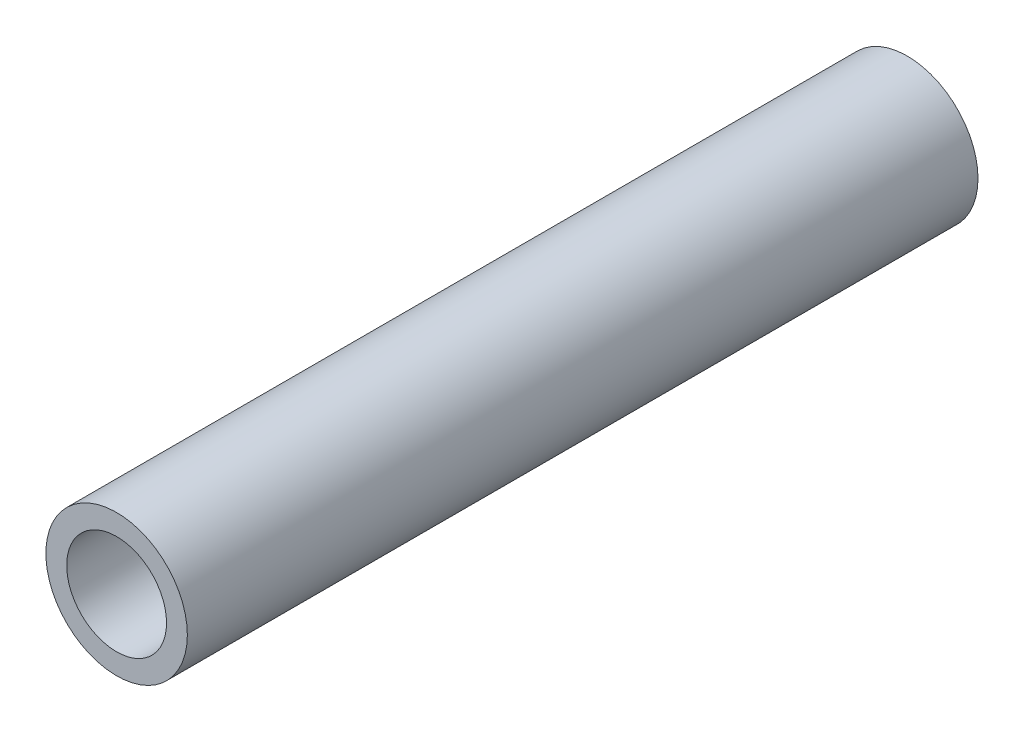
ISO-10303-21;
HEADER;
FILE_DESCRIPTION(('STEP AP214'),'2;1');
FILE_NAME('part.step','',(''),(''),'','','');
FILE_SCHEMA(('AUTOMOTIVE_DESIGN { 1 0 10303 214 1 1 1 1 }'));
ENDSEC;
DATA;
#1=APPLICATION_CONTEXT('core data for automotive mechanical design processes');
#2=APPLICATION_PROTOCOL_DEFINITION('international standard','automotive_design',2000,#1);
#3=PRODUCT_CONTEXT('',#1,'mechanical');
#4=PRODUCT('Part','Part','',(#3));
#5=PRODUCT_RELATED_PRODUCT_CATEGORY('part','',(#4));
#6=PRODUCT_DEFINITION_FORMATION('','',#4);
#7=PRODUCT_DEFINITION_CONTEXT('part definition',#1,'design');
#8=PRODUCT_DEFINITION('design','',#6,#7);
#9=PRODUCT_DEFINITION_SHAPE('','',#8);
#10=(LENGTH_UNIT() NAMED_UNIT(*) SI_UNIT(.MILLI.,.METRE.));
#11=(NAMED_UNIT(*) PLANE_ANGLE_UNIT() SI_UNIT($,.RADIAN.));
#12=(NAMED_UNIT(*) SI_UNIT($,.STERADIAN.) SOLID_ANGLE_UNIT());
#13=UNCERTAINTY_MEASURE_WITH_UNIT(LENGTH_MEASURE(1.E-05),#10,'distance_accuracy_value','');
#14=(GEOMETRIC_REPRESENTATION_CONTEXT(3) GLOBAL_UNCERTAINTY_ASSIGNED_CONTEXT((#13)) GLOBAL_UNIT_ASSIGNED_CONTEXT((#10,
#11,#12)) REPRESENTATION_CONTEXT('',''));
#15=CARTESIAN_POINT('',(0.,0.,0.));
#16=DIRECTION('',(0.,0.,1.));
#17=DIRECTION('',(1.,0.,0.));
#18=AXIS2_PLACEMENT_3D('',#15,#16,#17);
#19=CARTESIAN_POINT('',(0.,0.,95.));
#20=DIRECTION('',(0.,0.,1.));
#21=DIRECTION('',(1.,0.,0.));
#22=AXIS2_PLACEMENT_3D('',#19,#20,#21);
#23=PLANE('',#22);
#24=CARTESIAN_POINT('',(0.,0.,95.));
#25=DIRECTION('',(0.,0.,1.));
#26=DIRECTION('',(1.,0.,0.));
#27=AXIS2_PLACEMENT_3D('',#24,#25,#26);
#28=CIRCLE('',#27,8.5);
#29=CARTESIAN_POINT('',(8.5,0.,95.));
#30=VERTEX_POINT('',#29);
#31=EDGE_CURVE('E10',#30,#30,#28,.T.);
#32=ORIENTED_EDGE('',*,*,#31,.T.);
#33=EDGE_LOOP('',(#32));
#34=FACE_BOUND('',#33,.T.);
#35=CARTESIAN_POINT('',(0.,0.,95.));
#36=DIRECTION('',(0.,0.,1.));
#37=DIRECTION('',(1.,0.,0.));
#38=AXIS2_PLACEMENT_3D('',#35,#36,#37);
#39=CIRCLE('',#38,6.);
#40=CARTESIAN_POINT('',(6.,0.,95.));
#41=VERTEX_POINT('',#40);
#42=EDGE_CURVE('E45',#41,#41,#39,.T.);
#43=ORIENTED_EDGE('',*,*,#42,.F.);
#44=EDGE_LOOP('',(#43));
#45=FACE_BOUND('',#44,.T.);
#46=ADVANCED_FACE('F34',(#34,#45),#23,.T.);
#47=CARTESIAN_POINT('',(0.,0.,0.));
#48=DIRECTION('',(0.,0.,1.));
#49=DIRECTION('',(1.,0.,0.));
#50=AXIS2_PLACEMENT_3D('',#47,#48,#49);
#51=PLANE('',#50);
#52=CARTESIAN_POINT('',(0.,0.,0.));
#53=DIRECTION('',(0.,0.,1.));
#54=DIRECTION('',(1.,0.,0.));
#55=AXIS2_PLACEMENT_3D('',#52,#53,#54);
#56=CIRCLE('',#55,8.5);
#57=CARTESIAN_POINT('',(8.5,0.,0.));
#58=VERTEX_POINT('',#57);
#59=EDGE_CURVE('E41',#58,#58,#56,.T.);
#60=ORIENTED_EDGE('',*,*,#59,.F.);
#61=EDGE_LOOP('',(#60));
#62=FACE_BOUND('',#61,.T.);
#63=CARTESIAN_POINT('',(0.,0.,0.));
#64=DIRECTION('',(0.,0.,1.));
#65=DIRECTION('',(1.,0.,0.));
#66=AXIS2_PLACEMENT_3D('',#63,#64,#65);
#67=CIRCLE('',#66,6.);
#68=CARTESIAN_POINT('',(6.,0.,0.));
#69=VERTEX_POINT('',#68);
#70=EDGE_CURVE('E49',#69,#69,#67,.T.);
#71=ORIENTED_EDGE('',*,*,#70,.T.);
#72=EDGE_LOOP('',(#71));
#73=FACE_BOUND('',#72,.T.);
#74=ADVANCED_FACE('F55',(#62,#73),#51,.F.);
#75=CARTESIAN_POINT('',(0.,0.,95.));
#76=DIRECTION('',(0.,0.,-1.));
#77=DIRECTION('',(-1.,0.,0.));
#78=AXIS2_PLACEMENT_3D('',#75,#76,#77);
#79=CYLINDRICAL_SURFACE('',#78,8.5);
#80=ORIENTED_EDGE('',*,*,#31,.F.);
#81=EDGE_LOOP('',(#80));
#82=FACE_BOUND('',#81,.T.);
#83=ORIENTED_EDGE('',*,*,#59,.T.);
#84=EDGE_LOOP('',(#83));
#85=FACE_BOUND('',#84,.T.);
#86=ADVANCED_FACE('F36',(#82,#85),#79,.T.);
#87=CARTESIAN_POINT('',(0.,0.,95.));
#88=DIRECTION('',(0.,0.,-1.));
#89=DIRECTION('',(-1.,0.,0.));
#90=AXIS2_PLACEMENT_3D('',#87,#88,#89);
#91=CYLINDRICAL_SURFACE('',#90,6.);
#92=ORIENTED_EDGE('',*,*,#42,.T.);
#93=EDGE_LOOP('',(#92));
#94=FACE_BOUND('',#93,.T.);
#95=ORIENTED_EDGE('',*,*,#70,.F.);
#96=EDGE_LOOP('',(#95));
#97=FACE_BOUND('',#96,.T.);
#98=ADVANCED_FACE('F57',(#94,#97),#91,.F.);
#99=CLOSED_SHELL('',(#46,#74,#86,#98));
#100=MANIFOLD_SOLID_BREP('B2',#99);
#101=ADVANCED_BREP_SHAPE_REPRESENTATION('',(#18,#100),#14);
#102=SHAPE_DEFINITION_REPRESENTATION(#9,#101);
ENDSEC;
END-ISO-10303-21;
